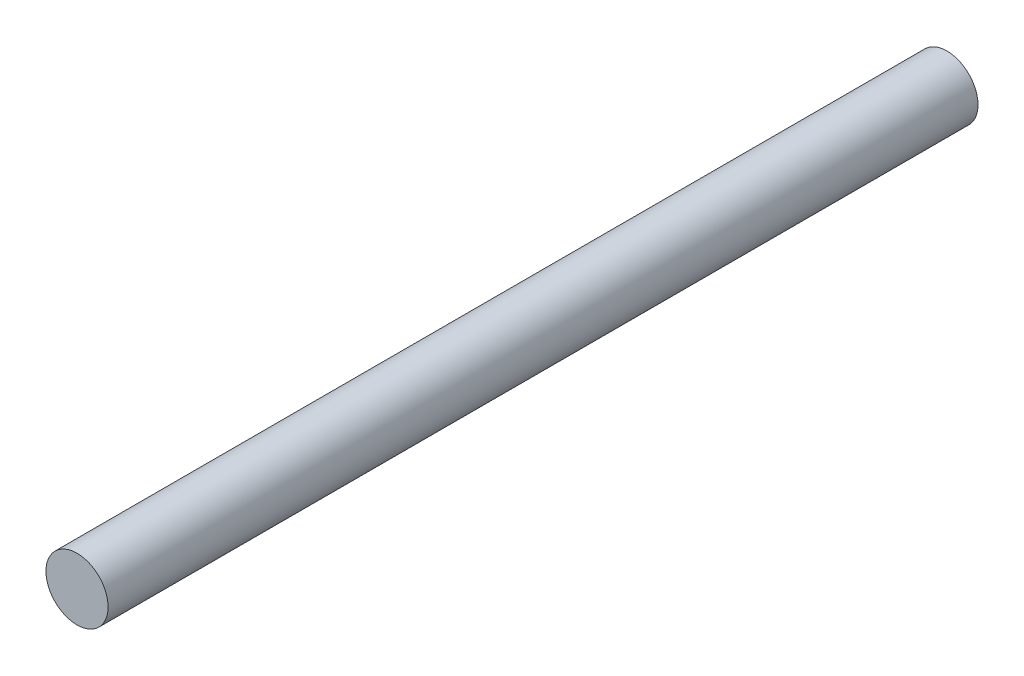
from build123d import *

# Parameters (mm, degrees)
SKETCH1_R           = 14.2875
BOSS_EXTRUDE1_DEPTH = 400


with BuildPart() as part:
    # Sketch1 → Boss-Extrude1 (new body)
    with BuildSketch(Plane.XY):
        Circle(SKETCH1_R)
    extrude(amount=BOSS_EXTRUDE1_DEPTH)


solid = part.part
